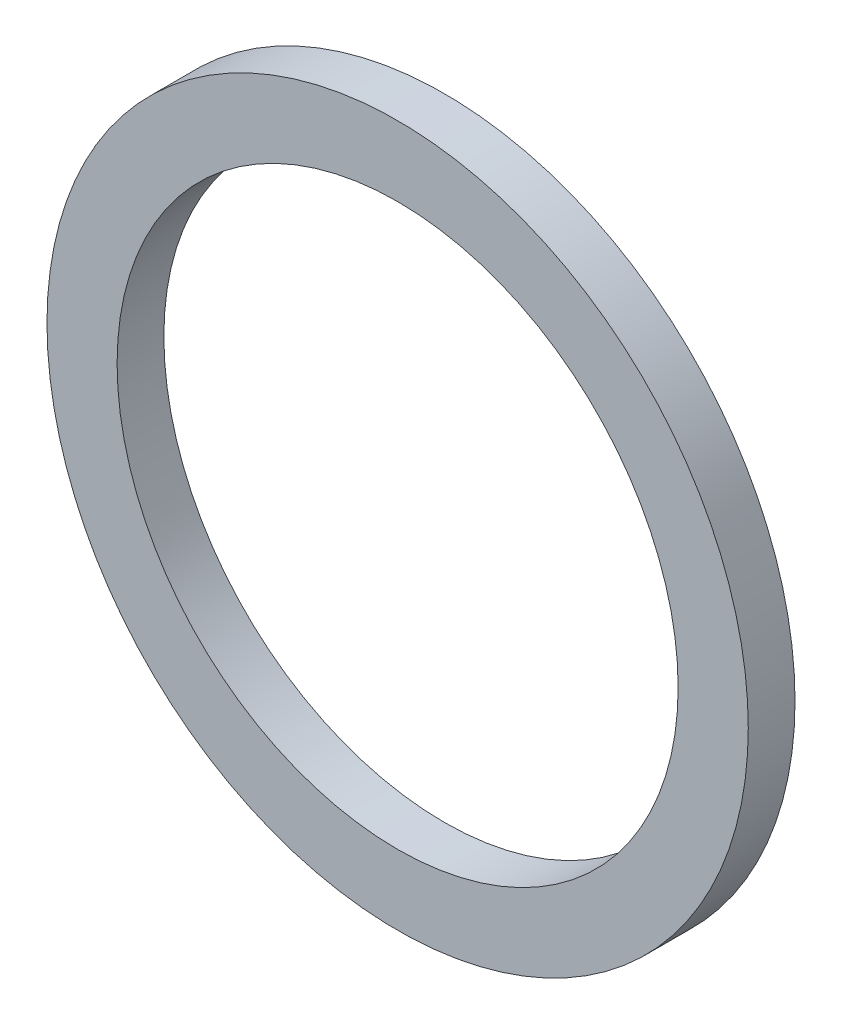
from build123d import *

# Parameters (mm, degrees)
SKETCH_1_R      = 7.5
SKETCH_1_R_2    = 6
EXTRUDE_1_DEPTH = 1


with BuildPart() as part:
    # Sketch 1 → Extrude 1 (new body)
    with BuildSketch(Plane.XY.offset(1)):
        Circle(SKETCH_1_R)
        Circle(SKETCH_1_R_2, mode=Mode.SUBTRACT)
    extrude(amount=EXTRUDE_1_DEPTH)


solid = part.part
